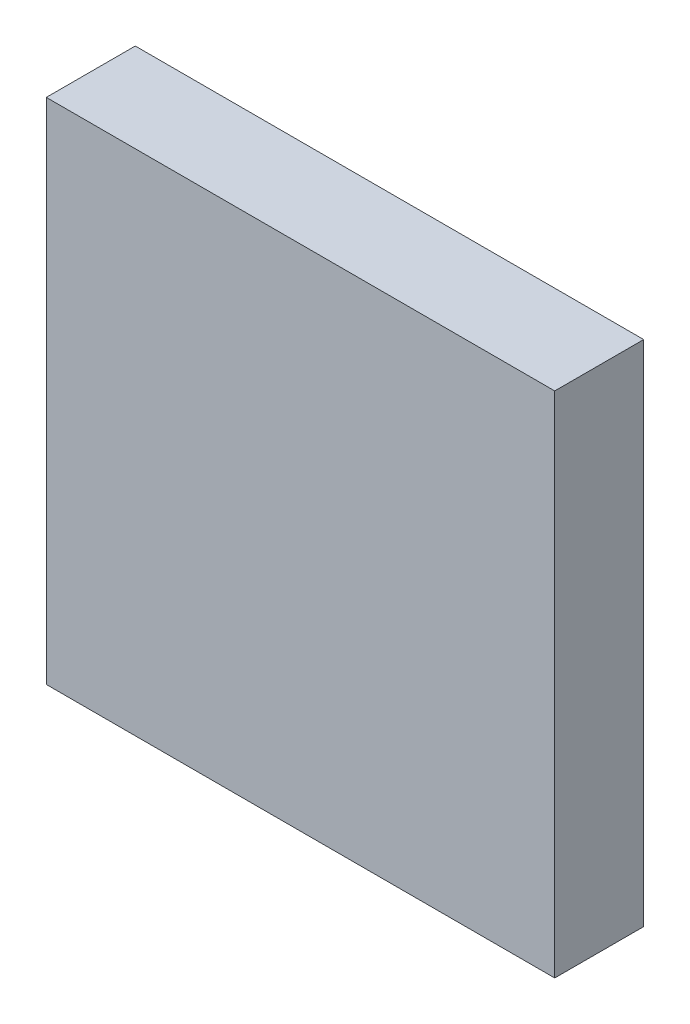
ISO-10303-21;
HEADER;
FILE_DESCRIPTION(('STEP AP214'),'2;1');
FILE_NAME('part.step','',(''),(''),'','','');
FILE_SCHEMA(('AUTOMOTIVE_DESIGN { 1 0 10303 214 1 1 1 1 }'));
ENDSEC;
DATA;
#1=APPLICATION_CONTEXT('core data for automotive mechanical design processes');
#2=APPLICATION_PROTOCOL_DEFINITION('international standard','automotive_design',2000,#1);
#3=PRODUCT_CONTEXT('',#1,'mechanical');
#4=PRODUCT('Part','Part','',(#3));
#5=PRODUCT_RELATED_PRODUCT_CATEGORY('part','',(#4));
#6=PRODUCT_DEFINITION_FORMATION('','',#4);
#7=PRODUCT_DEFINITION_CONTEXT('part definition',#1,'design');
#8=PRODUCT_DEFINITION('design','',#6,#7);
#9=PRODUCT_DEFINITION_SHAPE('','',#8);
#10=(LENGTH_UNIT() NAMED_UNIT(*) SI_UNIT(.MILLI.,.METRE.));
#11=(NAMED_UNIT(*) PLANE_ANGLE_UNIT() SI_UNIT($,.RADIAN.));
#12=(NAMED_UNIT(*) SI_UNIT($,.STERADIAN.) SOLID_ANGLE_UNIT());
#13=UNCERTAINTY_MEASURE_WITH_UNIT(LENGTH_MEASURE(1.E-05),#10,'distance_accuracy_value','');
#14=(GEOMETRIC_REPRESENTATION_CONTEXT(3) GLOBAL_UNCERTAINTY_ASSIGNED_CONTEXT((#13)) GLOBAL_UNIT_ASSIGNED_CONTEXT((#10,
#11,#12)) REPRESENTATION_CONTEXT('',''));
#15=CARTESIAN_POINT('',(0.,0.,0.));
#16=DIRECTION('',(0.,0.,1.));
#17=DIRECTION('',(1.,0.,0.));
#18=AXIS2_PLACEMENT_3D('',#15,#16,#17);
#19=CARTESIAN_POINT('',(-40.,60.,3.5));
#20=DIRECTION('',(1.,0.,0.));
#21=DIRECTION('',(0.,0.,-1.));
#22=AXIS2_PLACEMENT_3D('',#19,#20,#21);
#23=PLANE('',#22);
#24=DIRECTION('',(0.,-1.,0.));
#25=VECTOR('',#24,1.);
#26=CARTESIAN_POINT('',(-40.,60.,0.));
#27=LINE('',#26,#25);
#28=CARTESIAN_POINT('',(-40.,60.,0.));
#29=VERTEX_POINT('',#28);
#30=CARTESIAN_POINT('',(-40.,40.,0.));
#31=VERTEX_POINT('',#30);
#32=EDGE_CURVE('E74',#29,#31,#27,.T.);
#33=ORIENTED_EDGE('',*,*,#32,.T.);
#34=DIRECTION('',(0.,0.,-1.));
#35=VECTOR('',#34,1.);
#36=CARTESIAN_POINT('',(-40.,40.,3.5));
#37=LINE('',#36,#35);
#38=CARTESIAN_POINT('',(-40.,40.,3.5));
#39=VERTEX_POINT('',#38);
#40=EDGE_CURVE('E11',#39,#31,#37,.T.);
#41=ORIENTED_EDGE('',*,*,#40,.F.);
#42=DIRECTION('',(0.,-1.,0.));
#43=VECTOR('',#42,1.);
#44=CARTESIAN_POINT('',(-40.,60.,3.5));
#45=LINE('',#44,#43);
#46=CARTESIAN_POINT('',(-40.,60.,3.5));
#47=VERTEX_POINT('',#46);
#48=EDGE_CURVE('E92',#47,#39,#45,.T.);
#49=ORIENTED_EDGE('',*,*,#48,.F.);
#50=DIRECTION('',(0.,0.,-1.));
#51=VECTOR('',#50,1.);
#52=CARTESIAN_POINT('',(-40.,60.,3.5));
#53=LINE('',#52,#51);
#54=EDGE_CURVE('E86',#47,#29,#53,.T.);
#55=ORIENTED_EDGE('',*,*,#54,.T.);
#56=EDGE_LOOP('',(#33,#41,#49,#55));
#57=FACE_BOUND('',#56,.T.);
#58=ADVANCED_FACE('F30',(#57),#23,.F.);
#59=CARTESIAN_POINT('',(-40.,40.,3.5));
#60=DIRECTION('',(0.,1.,0.));
#61=DIRECTION('',(0.,0.,1.));
#62=AXIS2_PLACEMENT_3D('',#59,#60,#61);
#63=PLANE('',#62);
#64=DIRECTION('',(1.,0.,0.));
#65=VECTOR('',#64,1.);
#66=CARTESIAN_POINT('',(-40.,40.,0.));
#67=LINE('',#66,#65);
#68=CARTESIAN_POINT('',(-20.,40.,0.));
#69=VERTEX_POINT('',#68);
#70=EDGE_CURVE('E70',#31,#69,#67,.T.);
#71=ORIENTED_EDGE('',*,*,#70,.T.);
#72=DIRECTION('',(0.,0.,-1.));
#73=VECTOR('',#72,1.);
#74=CARTESIAN_POINT('',(-20.,40.,3.5));
#75=LINE('',#74,#73);
#76=CARTESIAN_POINT('',(-20.,40.,3.5));
#77=VERTEX_POINT('',#76);
#78=EDGE_CURVE('E37',#77,#69,#75,.T.);
#79=ORIENTED_EDGE('',*,*,#78,.F.);
#80=DIRECTION('',(1.,0.,0.));
#81=VECTOR('',#80,1.);
#82=CARTESIAN_POINT('',(-40.,40.,3.5));
#83=LINE('',#82,#81);
#84=EDGE_CURVE('E82',#39,#77,#83,.T.);
#85=ORIENTED_EDGE('',*,*,#84,.F.);
#86=ORIENTED_EDGE('',*,*,#40,.T.);
#87=EDGE_LOOP('',(#71,#79,#85,#86));
#88=FACE_BOUND('',#87,.T.);
#89=ADVANCED_FACE('F81',(#88),#63,.F.);
#90=CARTESIAN_POINT('',(-20.,60.,3.5));
#91=DIRECTION('',(-1.,0.,0.));
#92=DIRECTION('',(0.,0.,1.));
#93=AXIS2_PLACEMENT_3D('',#90,#91,#92);
#94=PLANE('',#93);
#95=DIRECTION('',(0.,1.,0.));
#96=VECTOR('',#95,1.);
#97=CARTESIAN_POINT('',(-20.,60.,0.));
#98=LINE('',#97,#96);
#99=CARTESIAN_POINT('',(-20.,60.,0.));
#100=VERTEX_POINT('',#99);
#101=EDGE_CURVE('E75',#69,#100,#98,.T.);
#102=ORIENTED_EDGE('',*,*,#101,.T.);
#103=DIRECTION('',(0.,0.,-1.));
#104=VECTOR('',#103,1.);
#105=CARTESIAN_POINT('',(-20.,60.,3.5));
#106=LINE('',#105,#104);
#107=CARTESIAN_POINT('',(-20.,60.,3.5));
#108=VERTEX_POINT('',#107);
#109=EDGE_CURVE('E98',#108,#100,#106,.T.);
#110=ORIENTED_EDGE('',*,*,#109,.F.);
#111=DIRECTION('',(0.,1.,0.));
#112=VECTOR('',#111,1.);
#113=CARTESIAN_POINT('',(-20.,60.,3.5));
#114=LINE('',#113,#112);
#115=EDGE_CURVE('E49',#77,#108,#114,.T.);
#116=ORIENTED_EDGE('',*,*,#115,.F.);
#117=ORIENTED_EDGE('',*,*,#78,.T.);
#118=EDGE_LOOP('',(#102,#110,#116,#117));
#119=FACE_BOUND('',#118,.T.);
#120=ADVANCED_FACE('F101',(#119),#94,.F.);
#121=CARTESIAN_POINT('',(-40.,60.,3.5));
#122=DIRECTION('',(0.,-1.,0.));
#123=DIRECTION('',(0.,0.,-1.));
#124=AXIS2_PLACEMENT_3D('',#121,#122,#123);
#125=PLANE('',#124);
#126=DIRECTION('',(-1.,0.,0.));
#127=VECTOR('',#126,1.);
#128=CARTESIAN_POINT('',(-40.,60.,0.));
#129=LINE('',#128,#127);
#130=EDGE_CURVE('E90',#100,#29,#129,.T.);
#131=ORIENTED_EDGE('',*,*,#130,.T.);
#132=ORIENTED_EDGE('',*,*,#54,.F.);
#133=DIRECTION('',(-1.,0.,0.));
#134=VECTOR('',#133,1.);
#135=CARTESIAN_POINT('',(-40.,60.,3.5));
#136=LINE('',#135,#134);
#137=EDGE_CURVE('E44',#108,#47,#136,.T.);
#138=ORIENTED_EDGE('',*,*,#137,.F.);
#139=ORIENTED_EDGE('',*,*,#109,.T.);
#140=EDGE_LOOP('',(#131,#132,#138,#139));
#141=FACE_BOUND('',#140,.T.);
#142=ADVANCED_FACE('F103',(#141),#125,.F.);
#143=CARTESIAN_POINT('',(-40.,40.,3.5));
#144=DIRECTION('',(0.,0.,1.));
#145=DIRECTION('',(1.,0.,0.));
#146=AXIS2_PLACEMENT_3D('',#143,#144,#145);
#147=PLANE('',#146);
#148=ORIENTED_EDGE('',*,*,#48,.T.);
#149=ORIENTED_EDGE('',*,*,#84,.T.);
#150=ORIENTED_EDGE('',*,*,#115,.T.);
#151=ORIENTED_EDGE('',*,*,#137,.T.);
#152=EDGE_LOOP('',(#148,#149,#150,#151));
#153=FACE_BOUND('',#152,.T.);
#154=ADVANCED_FACE('F104',(#153),#147,.T.);
#155=CARTESIAN_POINT('',(-40.,40.,0.));
#156=DIRECTION('',(0.,0.,1.));
#157=DIRECTION('',(1.,0.,0.));
#158=AXIS2_PLACEMENT_3D('',#155,#156,#157);
#159=PLANE('',#158);
#160=ORIENTED_EDGE('',*,*,#32,.F.);
#161=ORIENTED_EDGE('',*,*,#130,.F.);
#162=ORIENTED_EDGE('',*,*,#101,.F.);
#163=ORIENTED_EDGE('',*,*,#70,.F.);
#164=EDGE_LOOP('',(#160,#161,#162,#163));
#165=FACE_BOUND('',#164,.T.);
#166=ADVANCED_FACE('F71',(#165),#159,.F.);
#167=CLOSED_SHELL('',(#58,#89,#120,#142,#154,#166));
#168=MANIFOLD_SOLID_BREP('B2',#167);
#169=ADVANCED_BREP_SHAPE_REPRESENTATION('',(#18,#168),#14);
#170=SHAPE_DEFINITION_REPRESENTATION(#9,#169);
ENDSEC;
END-ISO-10303-21;
